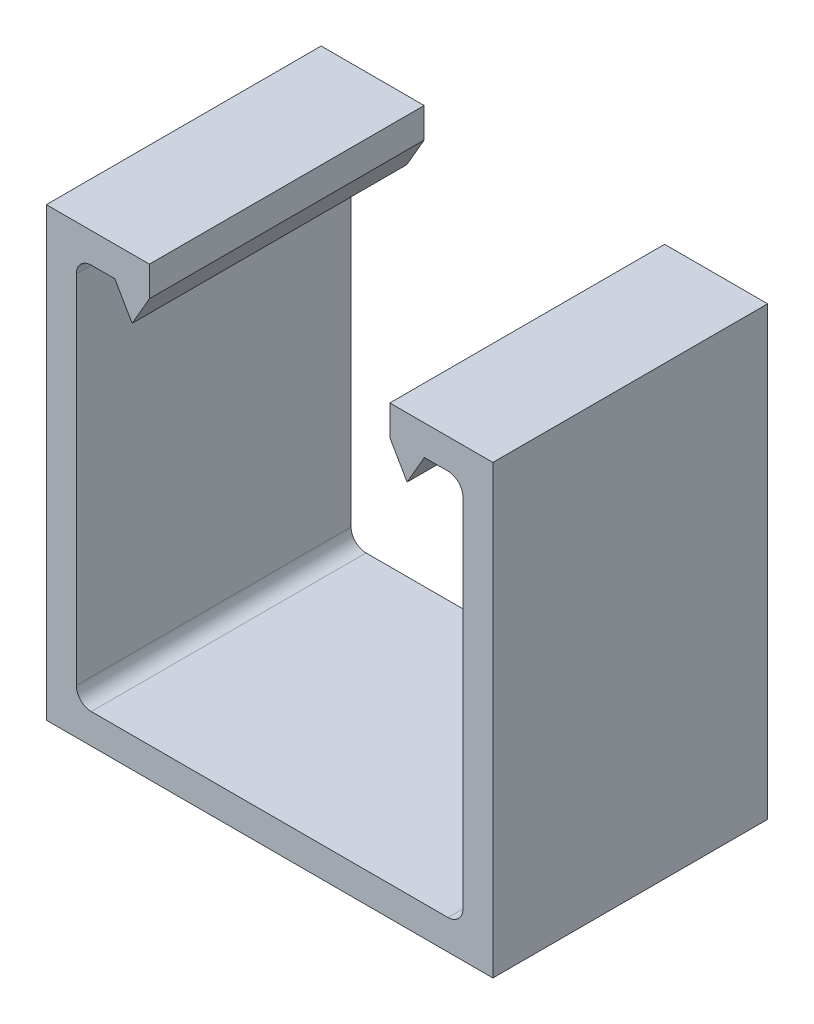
from build123d import *

# Parameters (mm, degrees)
BASE_EXTRUDE_DEPTH = 12.7


with BuildPart() as part:
    # Sketch1 → Base-Extrude (new, symmetric)
    with BuildSketch(Plane.XY):
        with BuildLine():
            Line((-11.1125, 20.6375), (-20.6375, 20.6375))
            Line((-20.6375, 20.6375), (-20.6375, -20.6375))
            Line((-20.6375, -20.6375), (20.6375, -20.6375))
            Line((20.6375, -20.6375), (20.6375, 20.6375))
            Line((20.6375, 20.6375), (11.1125, 20.6375))
            Line((11.1125, 20.6375), (11.1125, 17.8689))
            Line((11.1125, 17.8689), (12.710951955, 15.1003))
            Line((12.710951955, 15.1003), (14.309403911, 17.8689))
            Line((14.309403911, 17.8689), (16.4846, 17.8689))
            ThreePointArc((16.4846, 17.8689), (17.463447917, 17.463447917), (17.8689, 16.4846))
            Line((17.8689, 16.4846), (17.8689, -16.4846))
            ThreePointArc((17.8689, -16.4846), (17.463447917, -17.463447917), (16.4846, -17.8689))
            Line((16.4846, -17.8689), (-16.4846, -17.8689))
            ThreePointArc((-16.4846, -17.8689), (-17.463447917, -17.463447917), (-17.8689, -16.4846))
            Line((-17.8689, -16.4846), (-17.8689, 16.4846))
            ThreePointArc((-17.8689, 16.4846), (-17.463447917, 17.463447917), (-16.4846, 17.8689))
            Line((-16.4846, 17.8689), (-14.309403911, 17.8689))
            Line((-14.309403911, 17.8689), (-12.710951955, 15.1003))
            Line((-12.710951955, 15.1003), (-11.1125, 17.8689))
            Line((-11.1125, 17.8689), (-11.1125, 20.6375))
        make_face()
    extrude(amount=BASE_EXTRUDE_DEPTH, both=True)


solid = part.part
